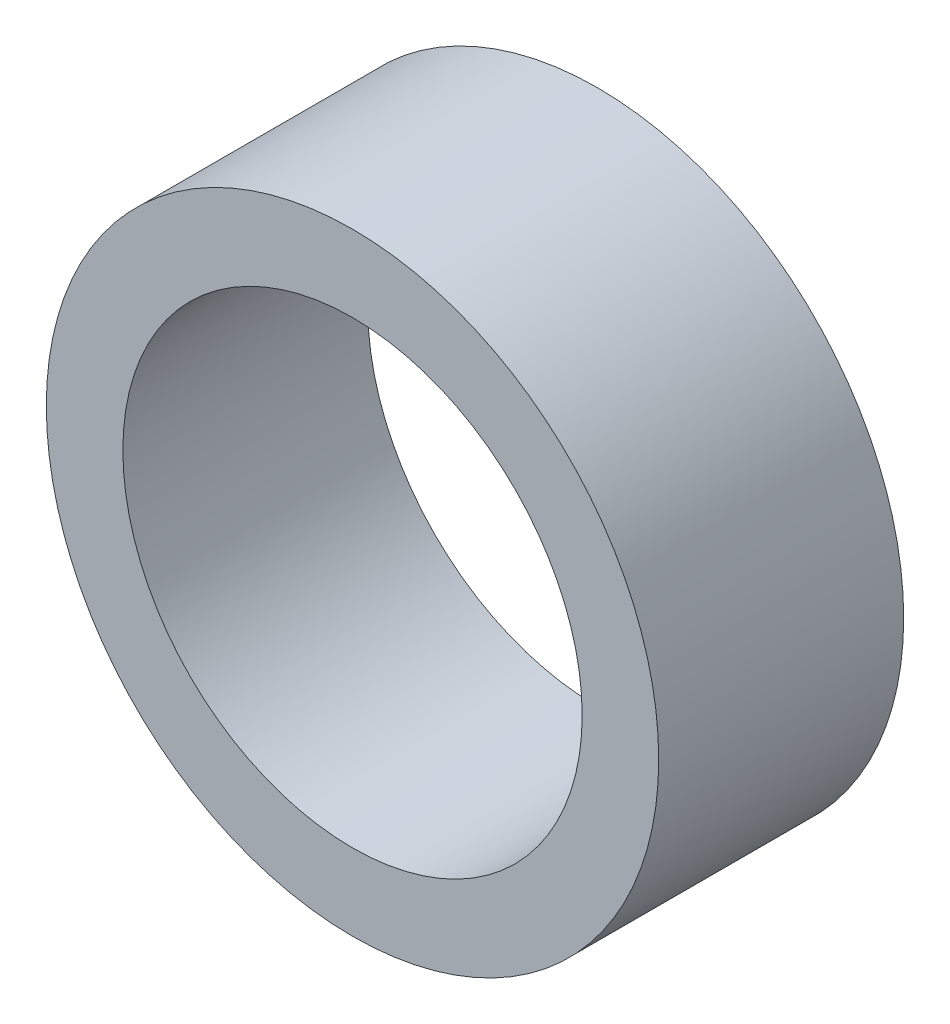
ISO-10303-21;
HEADER;
FILE_DESCRIPTION(('STEP AP214'),'2;1');
FILE_NAME('part.step','',(''),(''),'','','');
FILE_SCHEMA(('AUTOMOTIVE_DESIGN { 1 0 10303 214 1 1 1 1 }'));
ENDSEC;
DATA;
#1=APPLICATION_CONTEXT('core data for automotive mechanical design processes');
#2=APPLICATION_PROTOCOL_DEFINITION('international standard','automotive_design',2000,#1);
#3=PRODUCT_CONTEXT('',#1,'mechanical');
#4=PRODUCT('Part','Part','',(#3));
#5=PRODUCT_RELATED_PRODUCT_CATEGORY('part','',(#4));
#6=PRODUCT_DEFINITION_FORMATION('','',#4);
#7=PRODUCT_DEFINITION_CONTEXT('part definition',#1,'design');
#8=PRODUCT_DEFINITION('design','',#6,#7);
#9=PRODUCT_DEFINITION_SHAPE('','',#8);
#10=(LENGTH_UNIT() NAMED_UNIT(*) SI_UNIT(.MILLI.,.METRE.));
#11=(NAMED_UNIT(*) PLANE_ANGLE_UNIT() SI_UNIT($,.RADIAN.));
#12=(NAMED_UNIT(*) SI_UNIT($,.STERADIAN.) SOLID_ANGLE_UNIT());
#13=UNCERTAINTY_MEASURE_WITH_UNIT(LENGTH_MEASURE(1.E-05),#10,'distance_accuracy_value','');
#14=(GEOMETRIC_REPRESENTATION_CONTEXT(3) GLOBAL_UNCERTAINTY_ASSIGNED_CONTEXT((#13)) GLOBAL_UNIT_ASSIGNED_CONTEXT((#10,
#11,#12)) REPRESENTATION_CONTEXT('',''));
#15=CARTESIAN_POINT('',(0.,0.,0.));
#16=DIRECTION('',(0.,0.,1.));
#17=DIRECTION('',(1.,0.,0.));
#18=AXIS2_PLACEMENT_3D('',#15,#16,#17);
#19=CARTESIAN_POINT('',(0.,0.,6.34999999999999));
#20=DIRECTION('',(0.,0.,1.));
#21=DIRECTION('',(1.,0.,0.));
#22=AXIS2_PLACEMENT_3D('',#19,#20,#21);
#23=PLANE('',#22);
#24=CARTESIAN_POINT('',(0.,0.,6.34999999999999));
#25=DIRECTION('',(0.,0.,1.));
#26=DIRECTION('',(1.,0.,0.));
#27=AXIS2_PLACEMENT_3D('',#24,#25,#26);
#28=CIRCLE('',#27,3.175);
#29=CARTESIAN_POINT('',(3.17500000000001,0.,6.34999999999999));
#30=VERTEX_POINT('',#29);
#31=EDGE_CURVE('E10',#30,#30,#28,.T.);
#32=ORIENTED_EDGE('',*,*,#31,.T.);
#33=EDGE_LOOP('',(#32));
#34=FACE_BOUND('',#33,.T.);
#35=CARTESIAN_POINT('',(0.,0.,6.34999999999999));
#36=DIRECTION('',(0.,0.,1.));
#37=DIRECTION('',(1.,0.,0.));
#38=AXIS2_PLACEMENT_3D('',#35,#36,#37);
#39=CIRCLE('',#38,2.38125);
#40=CARTESIAN_POINT('',(2.38125,0.,6.34999999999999));
#41=VERTEX_POINT('',#40);
#42=EDGE_CURVE('E36',#41,#41,#39,.T.);
#43=ORIENTED_EDGE('',*,*,#42,.F.);
#44=EDGE_LOOP('',(#43));
#45=FACE_BOUND('',#44,.T.);
#46=ADVANCED_FACE('F28',(#34,#45),#23,.T.);
#47=CARTESIAN_POINT('',(0.,0.,6.34999999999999));
#48=DIRECTION('',(0.,0.,-1.));
#49=DIRECTION('',(-1.,0.,0.));
#50=AXIS2_PLACEMENT_3D('',#47,#48,#49);
#51=CYLINDRICAL_SURFACE('',#50,3.175);
#52=CARTESIAN_POINT('',(0.,0.,3.81));
#53=DIRECTION('',(0.,0.,1.));
#54=DIRECTION('',(1.,0.,0.));
#55=AXIS2_PLACEMENT_3D('',#52,#53,#54);
#56=CIRCLE('',#55,3.175);
#57=CARTESIAN_POINT('',(3.17500000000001,0.,3.81));
#58=VERTEX_POINT('',#57);
#59=EDGE_CURVE('E42',#58,#58,#56,.T.);
#60=ORIENTED_EDGE('',*,*,#59,.T.);
#61=EDGE_LOOP('',(#60));
#62=FACE_BOUND('',#61,.T.);
#63=ORIENTED_EDGE('',*,*,#31,.F.);
#64=EDGE_LOOP('',(#63));
#65=FACE_BOUND('',#64,.T.);
#66=ADVANCED_FACE('F30',(#62,#65),#51,.T.);
#67=CARTESIAN_POINT('',(0.,0.,6.34999999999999));
#68=DIRECTION('',(0.,0.,-1.));
#69=DIRECTION('',(-1.,0.,0.));
#70=AXIS2_PLACEMENT_3D('',#67,#68,#69);
#71=CYLINDRICAL_SURFACE('',#70,2.38125);
#72=CARTESIAN_POINT('',(0.,0.,3.81));
#73=DIRECTION('',(0.,0.,1.));
#74=DIRECTION('',(1.,0.,0.));
#75=AXIS2_PLACEMENT_3D('',#72,#73,#74);
#76=CIRCLE('',#75,2.38125);
#77=CARTESIAN_POINT('',(2.38125,0.,3.81));
#78=VERTEX_POINT('',#77);
#79=EDGE_CURVE('E32',#78,#78,#76,.T.);
#80=ORIENTED_EDGE('',*,*,#79,.F.);
#81=EDGE_LOOP('',(#80));
#82=FACE_BOUND('',#81,.T.);
#83=ORIENTED_EDGE('',*,*,#42,.T.);
#84=EDGE_LOOP('',(#83));
#85=FACE_BOUND('',#84,.T.);
#86=ADVANCED_FACE('F52',(#82,#85),#71,.F.);
#87=CARTESIAN_POINT('',(0.,0.,3.81));
#88=DIRECTION('',(0.,0.,1.));
#89=DIRECTION('',(1.,0.,0.));
#90=AXIS2_PLACEMENT_3D('',#87,#88,#89);
#91=PLANE('',#90);
#92=ORIENTED_EDGE('',*,*,#79,.T.);
#93=EDGE_LOOP('',(#92));
#94=FACE_BOUND('',#93,.T.);
#95=ORIENTED_EDGE('',*,*,#59,.F.);
#96=EDGE_LOOP('',(#95));
#97=FACE_BOUND('',#96,.T.);
#98=ADVANCED_FACE('F49',(#94,#97),#91,.F.);
#99=CLOSED_SHELL('',(#46,#66,#86,#98));
#100=MANIFOLD_SOLID_BREP('B2',#99);
#101=ADVANCED_BREP_SHAPE_REPRESENTATION('',(#18,#100),#14);
#102=SHAPE_DEFINITION_REPRESENTATION(#9,#101);
ENDSEC;
END-ISO-10303-21;
